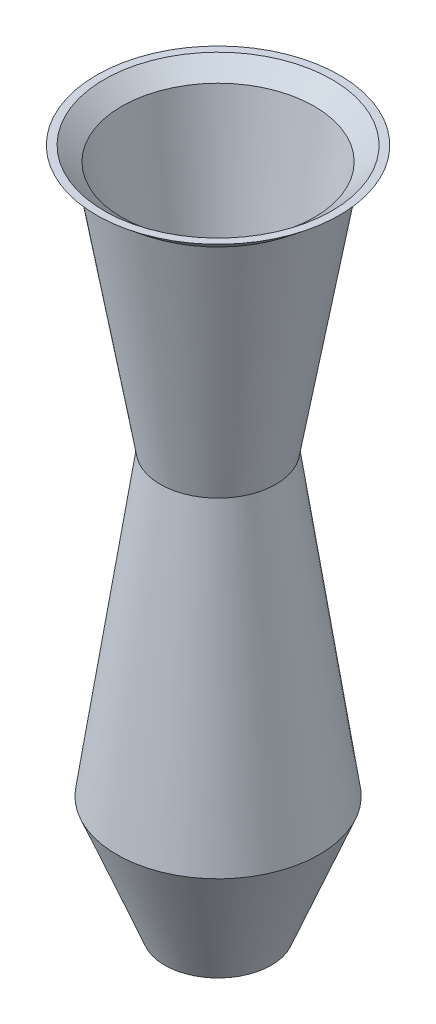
from build123d import *

# Parameters (mm, degrees)
FILLET2_R = 24.13
SHELL1_T  = 25.4


with BuildPart() as part:
    # Sketch1 → Revolve1 (revolve)
    with BuildSketch(Plane.XY):
        Polygon((0, -806.372693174), (254, -806.372693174), (508, -171.372693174), (279.4, 1403.427306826), (508, 2724.227306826), (600.71, 2800.427306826), (0, 2800.427306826), align=None)
    revolve(axis=Axis((0, -1178.671583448, 0), (0, 1, 0)))

    # Fillet2
    fillet2_edges = [part.edges().sort_by_distance(p)[0] for p in [
        (-279.4, 1403.427306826, 0),
    ]]
    fillet(fillet2_edges, radius=FILLET2_R)

    # Shell1
    shell1_openings = [part.faces().sort_by_distance(p)[0] for p in [
        (0, -806.372693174, 0),
        (0, 2800.427306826, 0),
    ]]
    offset(amount=SHELL1_T, openings=shell1_openings, kind=Kind.INTERSECTION)


solid = part.part
